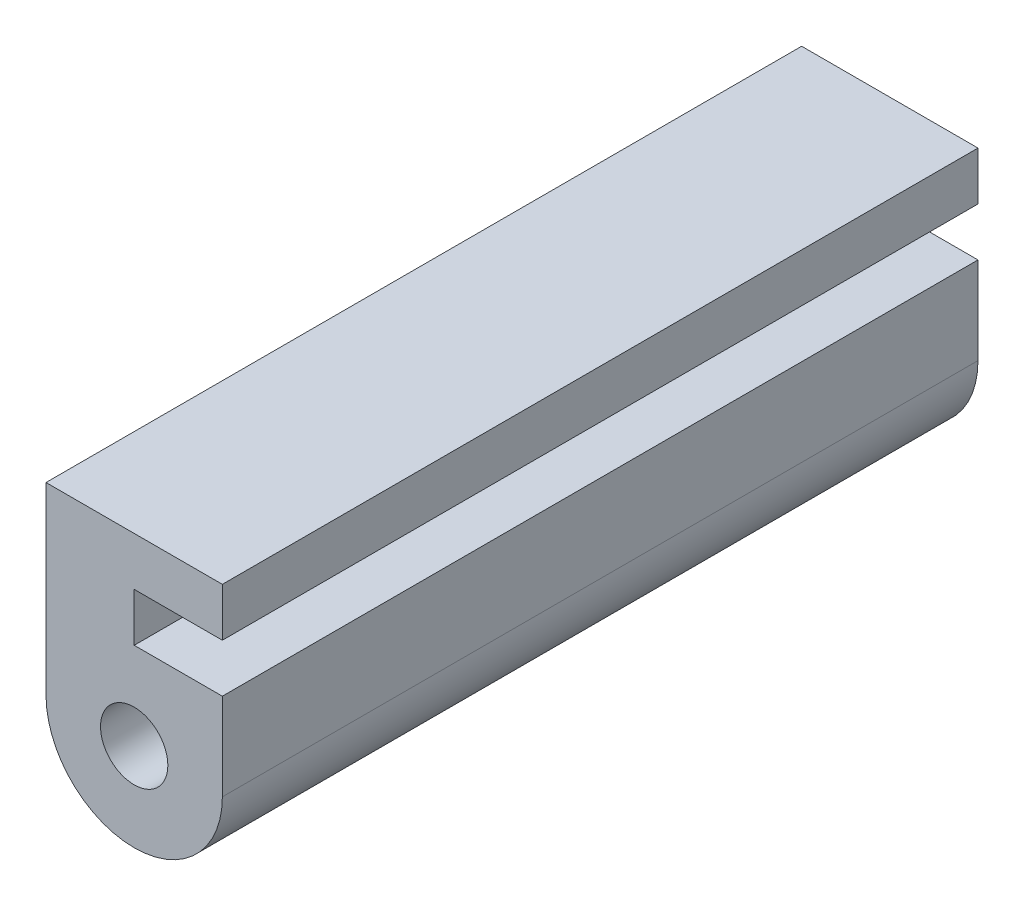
from build123d import *

# Parameters (mm, degrees)
SKETCH1_R           = 3.475
BOSS_EXTRUDE1_DEPTH = 78


with BuildPart() as part:
    # Sketch1 → Boss-Extrude1 (new body)
    with BuildSketch(Plane.XY):
        with BuildLine():
            Line((-9.102151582, 0), (-9.102151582, 19))
            Line((-9.102151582, 19), (9.102151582, 19))
            Line((9.102151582, 19), (9.102151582, 14))
            Line((9.102151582, 14), (0.002151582, 14))
            Line((0.002151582, 14), (0.002151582, 9))
            Line((0.002151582, 9), (9.102151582, 9))
            Line((9.102151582, 9), (9.102151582, 0))
            ThreePointArc((9.102151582, 0), (0, -9.102151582), (-9.102151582, 0))
        make_face()
        Circle(SKETCH1_R, mode=Mode.SUBTRACT)
    extrude(amount=BOSS_EXTRUDE1_DEPTH)


solid = part.part
